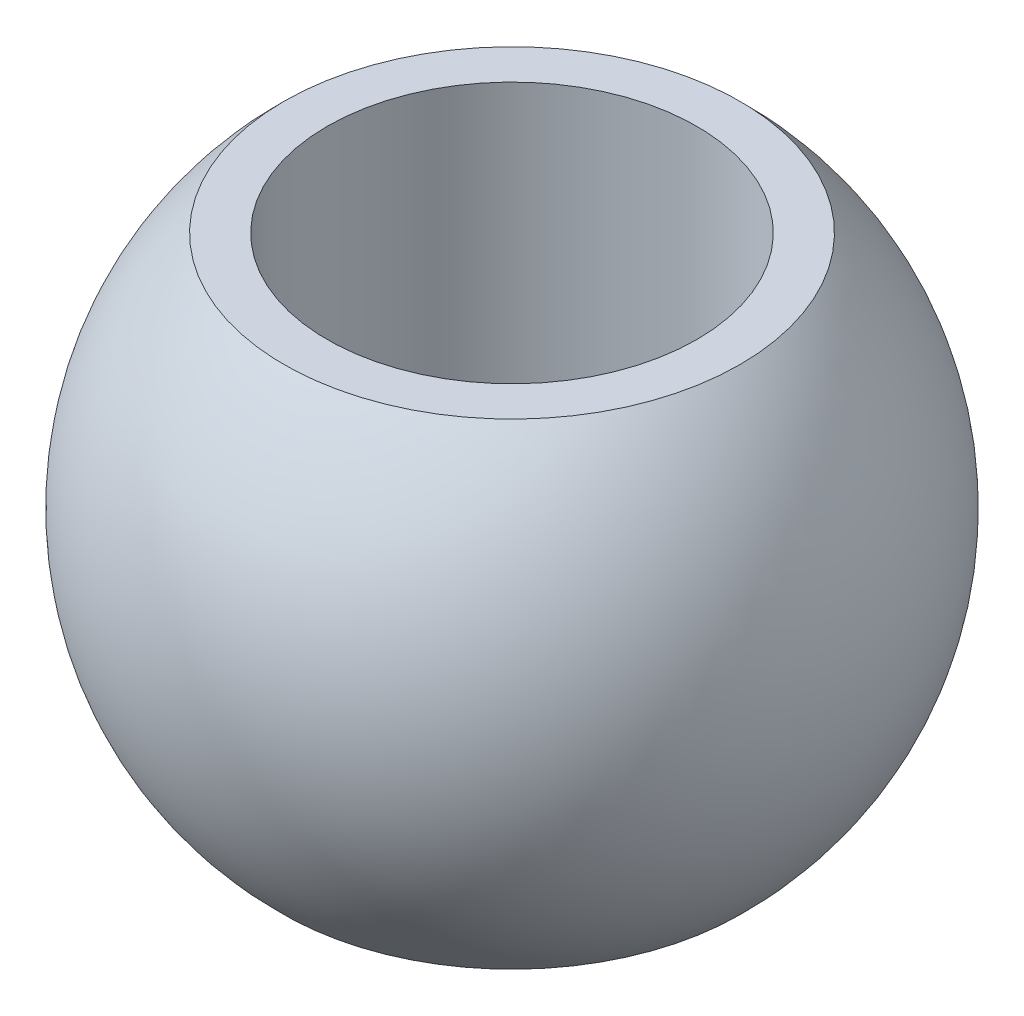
ISO-10303-21;
HEADER;
FILE_DESCRIPTION(('STEP AP214'),'2;1');
FILE_NAME('part.step','',(''),(''),'','','');
FILE_SCHEMA(('AUTOMOTIVE_DESIGN { 1 0 10303 214 1 1 1 1 }'));
ENDSEC;
DATA;
#1=APPLICATION_CONTEXT('core data for automotive mechanical design processes');
#2=APPLICATION_PROTOCOL_DEFINITION('international standard','automotive_design',2000,#1);
#3=PRODUCT_CONTEXT('',#1,'mechanical');
#4=PRODUCT('Part','Part','',(#3));
#5=PRODUCT_RELATED_PRODUCT_CATEGORY('part','',(#4));
#6=PRODUCT_DEFINITION_FORMATION('','',#4);
#7=PRODUCT_DEFINITION_CONTEXT('part definition',#1,'design');
#8=PRODUCT_DEFINITION('design','',#6,#7);
#9=PRODUCT_DEFINITION_SHAPE('','',#8);
#10=(LENGTH_UNIT() NAMED_UNIT(*) SI_UNIT(.MILLI.,.METRE.));
#11=(NAMED_UNIT(*) PLANE_ANGLE_UNIT() SI_UNIT($,.RADIAN.));
#12=(NAMED_UNIT(*) SI_UNIT($,.STERADIAN.) SOLID_ANGLE_UNIT());
#13=UNCERTAINTY_MEASURE_WITH_UNIT(LENGTH_MEASURE(1.E-05),#10,'distance_accuracy_value','');
#14=(GEOMETRIC_REPRESENTATION_CONTEXT(3) GLOBAL_UNCERTAINTY_ASSIGNED_CONTEXT((#13)) GLOBAL_UNIT_ASSIGNED_CONTEXT((#10,
#11,#12)) REPRESENTATION_CONTEXT('',''));
#15=CARTESIAN_POINT('',(0.,0.,0.));
#16=DIRECTION('',(0.,0.,1.));
#17=DIRECTION('',(1.,0.,0.));
#18=AXIS2_PLACEMENT_3D('',#15,#16,#17);
#19=CARTESIAN_POINT('',(0.,0.,0.));
#20=DIRECTION('',(1.,0.,0.));
#21=DIRECTION('',(0.,-1.,0.));
#22=AXIS2_PLACEMENT_3D('',#19,#20,#21);
#23=SPHERICAL_SURFACE('',#22,11.6);
#24=CARTESIAN_POINT('',(0.,0.,0.));
#25=DIRECTION('',(0.,1.,0.));
#26=DIRECTION('',(-1.,0.,0.));
#27=AXIS2_PLACEMENT_3D('',#24,#25,#26);
#28=SPHERICAL_SURFACE('',#27,11.6);
#29=CARTESIAN_POINT('',(0.,8.38,0.));
#30=DIRECTION('',(0.,1.,0.));
#31=DIRECTION('',(-1.,0.,0.));
#32=AXIS2_PLACEMENT_3D('',#29,#30,#31);
#33=CIRCLE('',#32,8.020947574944);
#34=CARTESIAN_POINT('',(-8.020947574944,8.37999999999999,0.));
#35=VERTEX_POINT('',#34);
#36=EDGE_CURVE('E33',#35,#35,#33,.F.);
#37=ORIENTED_EDGE('',*,*,#36,.T.);
#38=EDGE_LOOP('',(#37));
#39=FACE_BOUND('',#38,.T.);
#40=CARTESIAN_POINT('',(0.,-8.38,0.));
#41=DIRECTION('',(0.,-1.,0.));
#42=DIRECTION('',(1.,0.,0.));
#43=AXIS2_PLACEMENT_3D('',#40,#41,#42);
#44=CIRCLE('',#43,8.020947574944);
#45=CARTESIAN_POINT('',(8.020947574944,-8.38,0.));
#46=VERTEX_POINT('',#45);
#47=EDGE_CURVE('E10',#46,#46,#44,.F.);
#48=ORIENTED_EDGE('',*,*,#47,.T.);
#49=EDGE_LOOP('',(#48));
#50=FACE_BOUND('',#49,.T.);
#51=ADVANCED_FACE('F27',(#39,#50),#28,.T.);
#52=CARTESIAN_POINT('',(12.9088052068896,8.38,-15.));
#53=DIRECTION('',(0.,1.,0.));
#54=DIRECTION('',(-1.,0.,0.));
#55=AXIS2_PLACEMENT_3D('',#52,#53,#54);
#56=PLANE('',#55);
#57=CARTESIAN_POINT('',(0.,8.38,0.));
#58=DIRECTION('',(0.,1.,0.));
#59=DIRECTION('',(-1.,0.,0.));
#60=AXIS2_PLACEMENT_3D('',#57,#58,#59);
#61=CIRCLE('',#60,6.5);
#62=CARTESIAN_POINT('',(-6.5,8.38,0.));
#63=VERTEX_POINT('',#62);
#64=EDGE_CURVE('E41',#63,#63,#61,.T.);
#65=ORIENTED_EDGE('',*,*,#64,.F.);
#66=EDGE_LOOP('',(#65));
#67=FACE_BOUND('',#66,.T.);
#68=ORIENTED_EDGE('',*,*,#36,.F.);
#69=EDGE_LOOP('',(#68));
#70=FACE_BOUND('',#69,.T.);
#71=ADVANCED_FACE('F49',(#67,#70),#56,.T.);
#72=CARTESIAN_POINT('',(12.9088052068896,-8.38,-15.));
#73=DIRECTION('',(0.,-1.,0.));
#74=DIRECTION('',(1.,0.,0.));
#75=AXIS2_PLACEMENT_3D('',#72,#73,#74);
#76=PLANE('',#75);
#77=CARTESIAN_POINT('',(0.,-8.38,0.));
#78=DIRECTION('',(0.,1.,0.));
#79=DIRECTION('',(-1.,0.,0.));
#80=AXIS2_PLACEMENT_3D('',#77,#78,#79);
#81=CIRCLE('',#80,6.5);
#82=CARTESIAN_POINT('',(-6.5,-8.38,0.));
#83=VERTEX_POINT('',#82);
#84=EDGE_CURVE('E37',#83,#83,#81,.T.);
#85=ORIENTED_EDGE('',*,*,#84,.T.);
#86=EDGE_LOOP('',(#85));
#87=FACE_BOUND('',#86,.T.);
#88=ORIENTED_EDGE('',*,*,#47,.F.);
#89=EDGE_LOOP('',(#88));
#90=FACE_BOUND('',#89,.T.);
#91=ADVANCED_FACE('F52',(#87,#90),#76,.T.);
#92=CARTESIAN_POINT('',(0.,-8.38,0.));
#93=DIRECTION('',(0.,1.,0.));
#94=DIRECTION('',(-1.,0.,0.));
#95=AXIS2_PLACEMENT_3D('',#92,#93,#94);
#96=CYLINDRICAL_SURFACE('',#95,6.5);
#97=ORIENTED_EDGE('',*,*,#84,.F.);
#98=EDGE_LOOP('',(#97));
#99=FACE_BOUND('',#98,.T.);
#100=ORIENTED_EDGE('',*,*,#64,.T.);
#101=EDGE_LOOP('',(#100));
#102=FACE_BOUND('',#101,.T.);
#103=ADVANCED_FACE('F47',(#99,#102),#96,.F.);
#104=CLOSED_SHELL('',(#51,#71,#91,#103));
#105=MANIFOLD_SOLID_BREP('B2',#104);
#106=ADVANCED_BREP_SHAPE_REPRESENTATION('',(#18,#105),#14);
#107=SHAPE_DEFINITION_REPRESENTATION(#9,#106);
ENDSEC;
END-ISO-10303-21;
